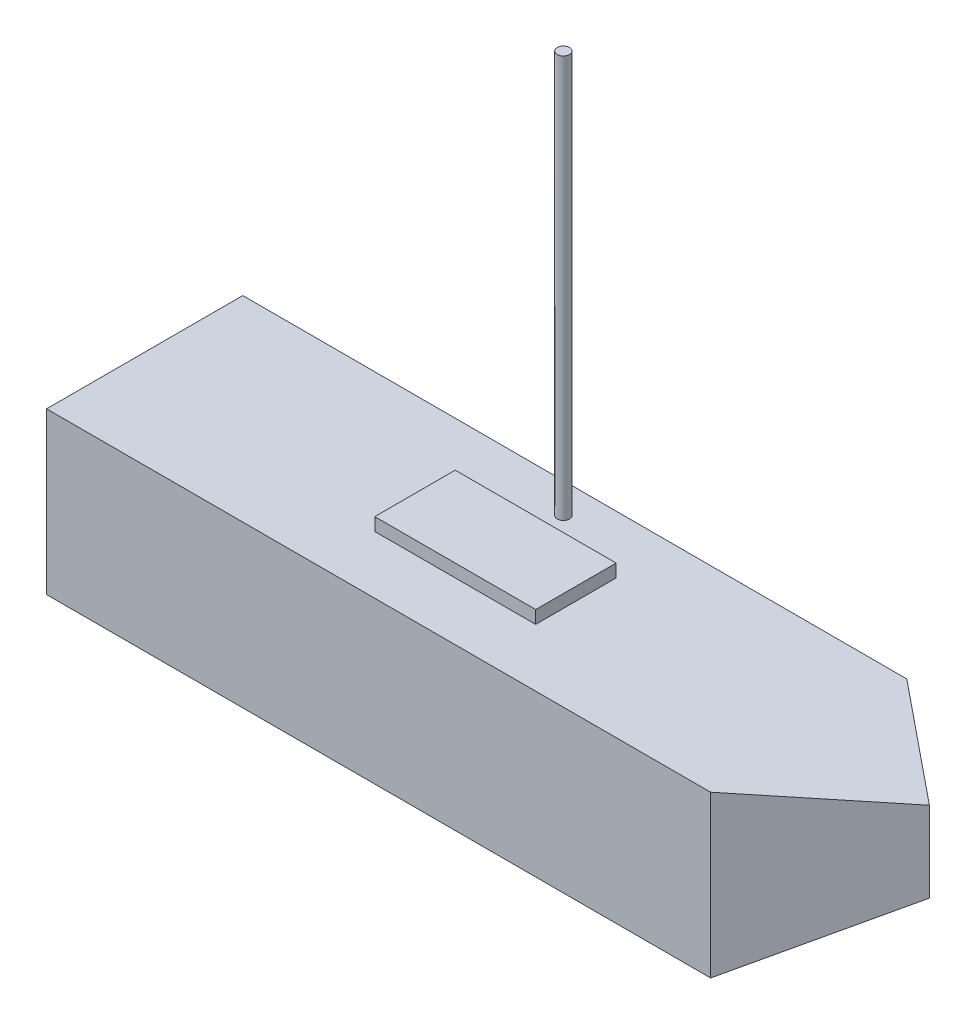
ISO-10303-21;
HEADER;
FILE_DESCRIPTION(('STEP AP214'),'2;1');
FILE_NAME('part.step','',(''),(''),'','','');
FILE_SCHEMA(('AUTOMOTIVE_DESIGN { 1 0 10303 214 1 1 1 1 }'));
ENDSEC;
DATA;
#1=APPLICATION_CONTEXT('core data for automotive mechanical design processes');
#2=APPLICATION_PROTOCOL_DEFINITION('international standard','automotive_design',2000,#1);
#3=PRODUCT_CONTEXT('',#1,'mechanical');
#4=PRODUCT('Part','Part','',(#3));
#5=PRODUCT_RELATED_PRODUCT_CATEGORY('part','',(#4));
#6=PRODUCT_DEFINITION_FORMATION('','',#4);
#7=PRODUCT_DEFINITION_CONTEXT('part definition',#1,'design');
#8=PRODUCT_DEFINITION('design','',#6,#7);
#9=PRODUCT_DEFINITION_SHAPE('','',#8);
#10=(LENGTH_UNIT() NAMED_UNIT(*) SI_UNIT(.MILLI.,.METRE.));
#11=(NAMED_UNIT(*) PLANE_ANGLE_UNIT() SI_UNIT($,.RADIAN.));
#12=(NAMED_UNIT(*) SI_UNIT($,.STERADIAN.) SOLID_ANGLE_UNIT());
#13=UNCERTAINTY_MEASURE_WITH_UNIT(LENGTH_MEASURE(1.E-05),#10,'distance_accuracy_value','');
#14=(GEOMETRIC_REPRESENTATION_CONTEXT(3) GLOBAL_UNCERTAINTY_ASSIGNED_CONTEXT((#13)) GLOBAL_UNIT_ASSIGNED_CONTEXT((#10,
#11,#12)) REPRESENTATION_CONTEXT('',''));
#15=CARTESIAN_POINT('',(0.,0.,0.));
#16=DIRECTION('',(0.,0.,1.));
#17=DIRECTION('',(1.,0.,0.));
#18=AXIS2_PLACEMENT_3D('',#15,#16,#17);
#19=CARTESIAN_POINT('',(0.,0.,0.));
#20=DIRECTION('',(0.,-1.,0.));
#21=DIRECTION('',(0.,0.,-1.));
#22=AXIS2_PLACEMENT_3D('',#19,#20,#21);
#23=PLANE('',#22);
#24=DIRECTION('',(0.,0.,1.));
#25=VECTOR('',#24,1.);
#26=CARTESIAN_POINT('',(906.7,0.,-298.65));
#27=LINE('',#26,#25);
#28=CARTESIAN_POINT('',(906.7,0.,-298.65));
#29=VERTEX_POINT('',#28);
#30=CARTESIAN_POINT('',(906.7,0.,-6.1500000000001));
#31=VERTEX_POINT('',#30);
#32=EDGE_CURVE('E219',#29,#31,#27,.T.);
#33=ORIENTED_EDGE('',*,*,#32,.F.);
#34=DIRECTION('',(1.,0.,0.));
#35=VECTOR('',#34,1.);
#36=CARTESIAN_POINT('',(906.7,0.,-298.65));
#37=LINE('',#36,#35);
#38=CARTESIAN_POINT('',(719.2,0.,-298.65));
#39=VERTEX_POINT('',#38);
#40=EDGE_CURVE('E230',#39,#29,#37,.T.);
#41=ORIENTED_EDGE('',*,*,#40,.F.);
#42=DIRECTION('',(0.,0.,1.));
#43=VECTOR('',#42,1.);
#44=CARTESIAN_POINT('',(719.2,0.,-298.65));
#45=LINE('',#44,#43);
#46=CARTESIAN_POINT('',(719.2,0.,-6.1500000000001));
#47=VERTEX_POINT('',#46);
#48=EDGE_CURVE('E218',#39,#47,#45,.T.);
#49=ORIENTED_EDGE('',*,*,#48,.T.);
#50=DIRECTION('',(1.,0.,0.));
#51=VECTOR('',#50,1.);
#52=CARTESIAN_POINT('',(906.7,0.,-6.1500000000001));
#53=LINE('',#52,#51);
#54=EDGE_CURVE('E234',#47,#31,#53,.T.);
#55=ORIENTED_EDGE('',*,*,#54,.T.);
#56=EDGE_LOOP('',(#33,#41,#49,#55));
#57=FACE_BOUND('',#56,.T.);
#58=DIRECTION('',(-1.,0.,0.));
#59=VECTOR('',#58,1.);
#60=CARTESIAN_POINT('',(0.,0.,-304.8));
#61=LINE('',#60,#59);
#62=CARTESIAN_POINT('',(1031.7,0.,-304.8));
#63=VERTEX_POINT('',#62);
#64=CARTESIAN_POINT('',(0.,0.,-304.8));
#65=VERTEX_POINT('',#64);
#66=EDGE_CURVE('E182',#63,#65,#61,.T.);
#67=ORIENTED_EDGE('',*,*,#66,.F.);
#68=DIRECTION('',(0.,0.,1.));
#69=VECTOR('',#68,1.);
#70=CARTESIAN_POINT('',(1031.7,0.,-152.4));
#71=LINE('',#70,#69);
#72=CARTESIAN_POINT('',(1031.7,0.,0.));
#73=VERTEX_POINT('',#72);
#74=EDGE_CURVE('E161',#63,#73,#71,.T.);
#75=ORIENTED_EDGE('',*,*,#74,.T.);
#76=DIRECTION('',(1.,0.,0.));
#77=VECTOR('',#76,1.);
#78=CARTESIAN_POINT('',(0.,0.,0.));
#79=LINE('',#78,#77);
#80=CARTESIAN_POINT('',(0.,0.,0.));
#81=VERTEX_POINT('',#80);
#82=EDGE_CURVE('E191',#81,#73,#79,.T.);
#83=ORIENTED_EDGE('',*,*,#82,.F.);
#84=DIRECTION('',(0.,0.,1.));
#85=VECTOR('',#84,1.);
#86=CARTESIAN_POINT('',(0.,0.,0.));
#87=LINE('',#86,#85);
#88=EDGE_CURVE('E189',#65,#81,#87,.T.);
#89=ORIENTED_EDGE('',*,*,#88,.F.);
#90=EDGE_LOOP('',(#67,#75,#83,#89));
#91=FACE_BOUND('',#90,.T.);
#92=ADVANCED_FACE('F74',(#57,#91),#23,.T.);
#93=CARTESIAN_POINT('',(1219.2,0.,-152.4));
#94=DIRECTION('',(-0.630732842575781,0.,0.776000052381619));
#95=DIRECTION('',(0.776000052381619,0.,0.630732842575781));
#96=AXIS2_PLACEMENT_3D('',#93,#94,#95);
#97=PLANE('',#96);
#98=DIRECTION('',(0.689231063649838,0.459487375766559,0.56020700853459));
#99=VECTOR('',#98,1.);
#100=CARTESIAN_POINT('',(1125.45,62.5,-228.6));
#101=LINE('',#100,#99);
#102=CARTESIAN_POINT('',(1219.2,125.,-152.4));
#103=VERTEX_POINT('',#102);
#104=EDGE_CURVE('E89',#63,#103,#101,.T.);
#105=ORIENTED_EDGE('',*,*,#104,.F.);
#106=DIRECTION('',(0.,1.,0.));
#107=VECTOR('',#106,1.);
#108=CARTESIAN_POINT('',(1031.7,0.,-304.8));
#109=LINE('',#108,#107);
#110=CARTESIAN_POINT('',(1031.7,250.,-304.8));
#111=VERTEX_POINT('',#110);
#112=EDGE_CURVE('E174',#63,#111,#109,.T.);
#113=ORIENTED_EDGE('',*,*,#112,.T.);
#114=DIRECTION('',(0.776000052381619,0.,0.630732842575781));
#115=VECTOR('',#114,1.);
#116=CARTESIAN_POINT('',(1219.2,250.,-152.4));
#117=LINE('',#116,#115);
#118=CARTESIAN_POINT('',(1219.2,250.,-152.4));
#119=VERTEX_POINT('',#118);
#120=EDGE_CURVE('E185',#111,#119,#117,.T.);
#121=ORIENTED_EDGE('',*,*,#120,.T.);
#122=DIRECTION('',(0.,1.,0.));
#123=VECTOR('',#122,1.);
#124=CARTESIAN_POINT('',(1219.2,0.,-152.4));
#125=LINE('',#124,#123);
#126=EDGE_CURVE('E176',#103,#119,#125,.T.);
#127=ORIENTED_EDGE('',*,*,#126,.F.);
#128=EDGE_LOOP('',(#105,#113,#121,#127));
#129=FACE_BOUND('',#128,.T.);
#130=ADVANCED_FACE('F172',(#129),#97,.F.);
#131=CARTESIAN_POINT('',(1219.2,0.,-152.4));
#132=DIRECTION('',(-0.63073284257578,0.,-0.77600005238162));
#133=DIRECTION('',(-0.77600005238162,0.,0.63073284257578));
#134=AXIS2_PLACEMENT_3D('',#131,#132,#133);
#135=PLANE('',#134);
#136=DIRECTION('',(0.689231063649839,0.459487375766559,-0.560207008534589));
#137=VECTOR('',#136,1.);
#138=CARTESIAN_POINT('',(1125.45,62.5,-76.2));
#139=LINE('',#138,#137);
#140=EDGE_CURVE('E163',#73,#103,#139,.T.);
#141=ORIENTED_EDGE('',*,*,#140,.T.);
#142=ORIENTED_EDGE('',*,*,#126,.T.);
#143=DIRECTION('',(-0.776000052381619,0.,0.63073284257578));
#144=VECTOR('',#143,1.);
#145=CARTESIAN_POINT('',(1219.2,250.,-152.4));
#146=LINE('',#145,#144);
#147=CARTESIAN_POINT('',(1031.7,250.,0.));
#148=VERTEX_POINT('',#147);
#149=EDGE_CURVE('E216',#119,#148,#146,.T.);
#150=ORIENTED_EDGE('',*,*,#149,.T.);
#151=DIRECTION('',(0.,1.,0.));
#152=VECTOR('',#151,1.);
#153=CARTESIAN_POINT('',(1031.7,0.,0.));
#154=LINE('',#153,#152);
#155=EDGE_CURVE('E214',#73,#148,#154,.T.);
#156=ORIENTED_EDGE('',*,*,#155,.F.);
#157=EDGE_LOOP('',(#141,#142,#150,#156));
#158=FACE_BOUND('',#157,.T.);
#159=ADVANCED_FACE('F277',(#158),#135,.F.);
#160=CARTESIAN_POINT('',(0.,250.,0.));
#161=DIRECTION('',(0.,-1.,0.));
#162=DIRECTION('',(0.,0.,-1.));
#163=AXIS2_PLACEMENT_3D('',#160,#161,#162);
#164=PLANE('',#163);
#165=CARTESIAN_POINT('',(545.,250.,-257.925));
#166=DIRECTION('',(0.,-1.,0.));
#167=DIRECTION('',(0.,0.,-1.));
#168=AXIS2_PLACEMENT_3D('',#165,#166,#167);
#169=CIRCLE('',#168,9.52500000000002);
#170=CARTESIAN_POINT('',(545.,250.,-267.45));
#171=VERTEX_POINT('',#170);
#172=EDGE_CURVE('E14',#171,#171,#169,.F.);
#173=ORIENTED_EDGE('',*,*,#172,.F.);
#174=EDGE_LOOP('',(#173));
#175=FACE_BOUND('',#174,.T.);
#176=DIRECTION('',(1.,0.,0.));
#177=VECTOR('',#176,1.);
#178=CARTESIAN_POINT('',(0.,250.,0.));
#179=LINE('',#178,#177);
#180=CARTESIAN_POINT('',(0.,250.,0.));
#181=VERTEX_POINT('',#180);
#182=EDGE_CURVE('E194',#181,#148,#179,.T.);
#183=ORIENTED_EDGE('',*,*,#182,.T.);
#184=ORIENTED_EDGE('',*,*,#149,.F.);
#185=ORIENTED_EDGE('',*,*,#120,.F.);
#186=DIRECTION('',(-1.,0.,0.));
#187=VECTOR('',#186,1.);
#188=CARTESIAN_POINT('',(0.,250.,-304.8));
#189=LINE('',#188,#187);
#190=CARTESIAN_POINT('',(0.,250.,-304.8));
#191=VERTEX_POINT('',#190);
#192=EDGE_CURVE('E184',#111,#191,#189,.T.);
#193=ORIENTED_EDGE('',*,*,#192,.T.);
#194=DIRECTION('',(0.,0.,1.));
#195=VECTOR('',#194,1.);
#196=CARTESIAN_POINT('',(0.,250.,0.));
#197=LINE('',#196,#195);
#198=EDGE_CURVE('E190',#191,#181,#197,.T.);
#199=ORIENTED_EDGE('',*,*,#198,.T.);
#200=EDGE_LOOP('',(#183,#184,#185,#193,#199));
#201=FACE_BOUND('',#200,.T.);
#202=DIRECTION('',(0.,0.,1.));
#203=VECTOR('',#202,1.);
#204=CARTESIAN_POINT('',(420.,250.,-89.9000000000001));
#205=LINE('',#204,#203);
#206=CARTESIAN_POINT('',(420.,250.,-214.9));
#207=VERTEX_POINT('',#206);
#208=CARTESIAN_POINT('',(420.,250.,-89.9000000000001));
#209=VERTEX_POINT('',#208);
#210=EDGE_CURVE('E264',#207,#209,#205,.T.);
#211=ORIENTED_EDGE('',*,*,#210,.F.);
#212=DIRECTION('',(-1.,0.,0.));
#213=VECTOR('',#212,1.);
#214=CARTESIAN_POINT('',(420.,250.,-214.9));
#215=LINE('',#214,#213);
#216=CARTESIAN_POINT('',(670.,250.,-214.9));
#217=VERTEX_POINT('',#216);
#218=EDGE_CURVE('E256',#217,#207,#215,.T.);
#219=ORIENTED_EDGE('',*,*,#218,.F.);
#220=DIRECTION('',(0.,0.,-1.));
#221=VECTOR('',#220,1.);
#222=CARTESIAN_POINT('',(670.,250.,-89.9000000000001));
#223=LINE('',#222,#221);
#224=CARTESIAN_POINT('',(670.,250.,-89.9000000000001));
#225=VERTEX_POINT('',#224);
#226=EDGE_CURVE('E260',#225,#217,#223,.T.);
#227=ORIENTED_EDGE('',*,*,#226,.F.);
#228=DIRECTION('',(1.,0.,0.));
#229=VECTOR('',#228,1.);
#230=CARTESIAN_POINT('',(420.,250.,-89.9000000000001));
#231=LINE('',#230,#229);
#232=EDGE_CURVE('E97',#209,#225,#231,.T.);
#233=ORIENTED_EDGE('',*,*,#232,.F.);
#234=EDGE_LOOP('',(#211,#219,#227,#233));
#235=FACE_BOUND('',#234,.T.);
#236=ADVANCED_FACE('F280',(#175,#201,#235),#164,.F.);
#237=CARTESIAN_POINT('',(0.,250.,0.));
#238=DIRECTION('',(1.,0.,0.));
#239=DIRECTION('',(0.,0.,-1.));
#240=AXIS2_PLACEMENT_3D('',#237,#238,#239);
#241=PLANE('',#240);
#242=ORIENTED_EDGE('',*,*,#88,.T.);
#243=DIRECTION('',(0.,-1.,0.));
#244=VECTOR('',#243,1.);
#245=CARTESIAN_POINT('',(0.,250.,0.));
#246=LINE('',#245,#244);
#247=EDGE_CURVE('E82',#181,#81,#246,.T.);
#248=ORIENTED_EDGE('',*,*,#247,.F.);
#249=ORIENTED_EDGE('',*,*,#198,.F.);
#250=DIRECTION('',(0.,-1.,0.));
#251=VECTOR('',#250,1.);
#252=CARTESIAN_POINT('',(0.,250.,-304.8));
#253=LINE('',#252,#251);
#254=EDGE_CURVE('E200',#191,#65,#253,.T.);
#255=ORIENTED_EDGE('',*,*,#254,.T.);
#256=EDGE_LOOP('',(#242,#248,#249,#255));
#257=FACE_BOUND('',#256,.T.);
#258=ADVANCED_FACE('F76',(#257),#241,.F.);
#259=CARTESIAN_POINT('',(0.,250.,0.));
#260=DIRECTION('',(0.,0.,-1.));
#261=DIRECTION('',(-1.,0.,0.));
#262=AXIS2_PLACEMENT_3D('',#259,#260,#261);
#263=PLANE('',#262);
#264=ORIENTED_EDGE('',*,*,#82,.T.);
#265=ORIENTED_EDGE('',*,*,#155,.T.);
#266=ORIENTED_EDGE('',*,*,#182,.F.);
#267=ORIENTED_EDGE('',*,*,#247,.T.);
#268=EDGE_LOOP('',(#264,#265,#266,#267));
#269=FACE_BOUND('',#268,.T.);
#270=ADVANCED_FACE('F204',(#269),#263,.F.);
#271=CARTESIAN_POINT('',(0.,250.,-304.8));
#272=DIRECTION('',(0.,0.,1.));
#273=DIRECTION('',(1.,0.,0.));
#274=AXIS2_PLACEMENT_3D('',#271,#272,#273);
#275=PLANE('',#274);
#276=ORIENTED_EDGE('',*,*,#192,.F.);
#277=ORIENTED_EDGE('',*,*,#112,.F.);
#278=ORIENTED_EDGE('',*,*,#66,.T.);
#279=ORIENTED_EDGE('',*,*,#254,.F.);
#280=EDGE_LOOP('',(#276,#277,#278,#279));
#281=FACE_BOUND('',#280,.T.);
#282=ADVANCED_FACE('F180',(#281),#275,.F.);
#283=CARTESIAN_POINT('',(719.2,0.,-298.65));
#284=DIRECTION('',(-0.315977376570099,0.9487667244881,0.));
#285=DIRECTION('',(-0.9487667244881,-0.315977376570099,0.));
#286=AXIS2_PLACEMENT_3D('',#283,#284,#285);
#287=PLANE('',#286);
#288=DIRECTION('',(-0.9487667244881,-0.315977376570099,0.));
#289=VECTOR('',#288,1.);
#290=CARTESIAN_POINT('',(719.2,0.,-6.1500000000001));
#291=LINE('',#290,#289);
#292=CARTESIAN_POINT('',(969.2,83.2600281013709,-6.1500000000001));
#293=VERTEX_POINT('',#292);
#294=EDGE_CURVE('E227',#293,#47,#291,.T.);
#295=ORIENTED_EDGE('',*,*,#294,.T.);
#296=ORIENTED_EDGE('',*,*,#48,.F.);
#297=DIRECTION('',(-0.9487667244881,-0.315977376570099,0.));
#298=VECTOR('',#297,1.);
#299=CARTESIAN_POINT('',(719.2,0.,-298.65));
#300=LINE('',#299,#298);
#301=CARTESIAN_POINT('',(969.2,83.2600281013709,-298.65));
#302=VERTEX_POINT('',#301);
#303=EDGE_CURVE('E223',#302,#39,#300,.T.);
#304=ORIENTED_EDGE('',*,*,#303,.F.);
#305=DIRECTION('',(0.,0.,1.));
#306=VECTOR('',#305,1.);
#307=CARTESIAN_POINT('',(969.2,83.2600281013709,-298.65));
#308=LINE('',#307,#306);
#309=EDGE_CURVE('E222',#302,#293,#308,.T.);
#310=ORIENTED_EDGE('',*,*,#309,.T.);
#311=EDGE_LOOP('',(#295,#296,#304,#310));
#312=FACE_BOUND('',#311,.T.);
#313=ADVANCED_FACE('F320',(#312),#287,.F.);
#314=CARTESIAN_POINT('',(969.2,83.2600281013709,-298.65));
#315=DIRECTION('',(0.799746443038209,-0.600337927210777,0.));
#316=DIRECTION('',(0.600337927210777,0.799746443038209,0.));
#317=AXIS2_PLACEMENT_3D('',#314,#315,#316);
#318=PLANE('',#317);
#319=DIRECTION('',(0.600337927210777,0.799746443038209,0.));
#320=VECTOR('',#319,1.);
#321=CARTESIAN_POINT('',(969.2,83.2600281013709,-6.1500000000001));
#322=LINE('',#321,#320);
#323=EDGE_CURVE('E231',#31,#293,#322,.T.);
#324=ORIENTED_EDGE('',*,*,#323,.T.);
#325=ORIENTED_EDGE('',*,*,#309,.F.);
#326=DIRECTION('',(0.600337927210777,0.799746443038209,0.));
#327=VECTOR('',#326,1.);
#328=CARTESIAN_POINT('',(969.2,83.2600281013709,-298.65));
#329=LINE('',#328,#327);
#330=EDGE_CURVE('E240',#29,#302,#329,.T.);
#331=ORIENTED_EDGE('',*,*,#330,.F.);
#332=ORIENTED_EDGE('',*,*,#32,.T.);
#333=EDGE_LOOP('',(#324,#325,#331,#332));
#334=FACE_BOUND('',#333,.T.);
#335=ADVANCED_FACE('F401',(#334),#318,.F.);
#336=CARTESIAN_POINT('',(0.,0.,-298.65));
#337=DIRECTION('',(0.,0.,1.));
#338=DIRECTION('',(1.,0.,0.));
#339=AXIS2_PLACEMENT_3D('',#336,#337,#338);
#340=PLANE('',#339);
#341=ORIENTED_EDGE('',*,*,#40,.T.);
#342=ORIENTED_EDGE('',*,*,#330,.T.);
#343=ORIENTED_EDGE('',*,*,#303,.T.);
#344=EDGE_LOOP('',(#341,#342,#343));
#345=FACE_BOUND('',#344,.T.);
#346=ADVANCED_FACE('F393',(#345),#340,.T.);
#347=CARTESIAN_POINT('',(0.,0.,-6.1500000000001));
#348=DIRECTION('',(0.,0.,1.));
#349=DIRECTION('',(1.,0.,0.));
#350=AXIS2_PLACEMENT_3D('',#347,#348,#349);
#351=PLANE('',#350);
#352=ORIENTED_EDGE('',*,*,#54,.F.);
#353=ORIENTED_EDGE('',*,*,#294,.F.);
#354=ORIENTED_EDGE('',*,*,#323,.F.);
#355=EDGE_LOOP('',(#352,#353,#354));
#356=FACE_BOUND('',#355,.T.);
#357=ADVANCED_FACE('F308',(#356),#351,.F.);
#358=CARTESIAN_POINT('',(420.,270.,-89.9000000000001));
#359=DIRECTION('',(1.,0.,0.));
#360=DIRECTION('',(0.,0.,-1.));
#361=AXIS2_PLACEMENT_3D('',#358,#359,#360);
#362=PLANE('',#361);
#363=ORIENTED_EDGE('',*,*,#210,.T.);
#364=DIRECTION('',(0.,-1.,0.));
#365=VECTOR('',#364,1.);
#366=CARTESIAN_POINT('',(420.,270.,-89.9000000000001));
#367=LINE('',#366,#365);
#368=CARTESIAN_POINT('',(420.,270.,-89.9000000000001));
#369=VERTEX_POINT('',#368);
#370=EDGE_CURVE('E237',#369,#209,#367,.T.);
#371=ORIENTED_EDGE('',*,*,#370,.F.);
#372=DIRECTION('',(0.,0.,1.));
#373=VECTOR('',#372,1.);
#374=CARTESIAN_POINT('',(420.,270.,-89.9000000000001));
#375=LINE('',#374,#373);
#376=CARTESIAN_POINT('',(420.,270.,-214.9));
#377=VERTEX_POINT('',#376);
#378=EDGE_CURVE('E259',#377,#369,#375,.T.);
#379=ORIENTED_EDGE('',*,*,#378,.F.);
#380=DIRECTION('',(0.,-1.,0.));
#381=VECTOR('',#380,1.);
#382=CARTESIAN_POINT('',(420.,270.,-214.9));
#383=LINE('',#382,#381);
#384=EDGE_CURVE('E252',#377,#207,#383,.T.);
#385=ORIENTED_EDGE('',*,*,#384,.T.);
#386=EDGE_LOOP('',(#363,#371,#379,#385));
#387=FACE_BOUND('',#386,.T.);
#388=ADVANCED_FACE('F292',(#387),#362,.F.);
#389=CARTESIAN_POINT('',(420.,270.,-89.9000000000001));
#390=DIRECTION('',(0.,0.,-1.));
#391=DIRECTION('',(-1.,0.,0.));
#392=AXIS2_PLACEMENT_3D('',#389,#390,#391);
#393=PLANE('',#392);
#394=ORIENTED_EDGE('',*,*,#232,.T.);
#395=DIRECTION('',(0.,-1.,0.));
#396=VECTOR('',#395,1.);
#397=CARTESIAN_POINT('',(670.,270.,-89.9000000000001));
#398=LINE('',#397,#396);
#399=CARTESIAN_POINT('',(670.,270.,-89.9000000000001));
#400=VERTEX_POINT('',#399);
#401=EDGE_CURVE('E246',#400,#225,#398,.T.);
#402=ORIENTED_EDGE('',*,*,#401,.F.);
#403=DIRECTION('',(1.,0.,0.));
#404=VECTOR('',#403,1.);
#405=CARTESIAN_POINT('',(420.,270.,-89.9000000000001));
#406=LINE('',#405,#404);
#407=EDGE_CURVE('E270',#369,#400,#406,.T.);
#408=ORIENTED_EDGE('',*,*,#407,.F.);
#409=ORIENTED_EDGE('',*,*,#370,.T.);
#410=EDGE_LOOP('',(#394,#402,#408,#409));
#411=FACE_BOUND('',#410,.T.);
#412=ADVANCED_FACE('F300',(#411),#393,.F.);
#413=CARTESIAN_POINT('',(670.,270.,-89.9000000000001));
#414=DIRECTION('',(-1.,0.,0.));
#415=DIRECTION('',(0.,0.,1.));
#416=AXIS2_PLACEMENT_3D('',#413,#414,#415);
#417=PLANE('',#416);
#418=ORIENTED_EDGE('',*,*,#226,.T.);
#419=DIRECTION('',(0.,-1.,0.));
#420=VECTOR('',#419,1.);
#421=CARTESIAN_POINT('',(670.,270.,-214.9));
#422=LINE('',#421,#420);
#423=CARTESIAN_POINT('',(670.,270.,-214.9));
#424=VERTEX_POINT('',#423);
#425=EDGE_CURVE('E249',#424,#217,#422,.T.);
#426=ORIENTED_EDGE('',*,*,#425,.F.);
#427=DIRECTION('',(0.,0.,-1.));
#428=VECTOR('',#427,1.);
#429=CARTESIAN_POINT('',(670.,270.,-89.9000000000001));
#430=LINE('',#429,#428);
#431=EDGE_CURVE('E268',#400,#424,#430,.T.);
#432=ORIENTED_EDGE('',*,*,#431,.F.);
#433=ORIENTED_EDGE('',*,*,#401,.T.);
#434=EDGE_LOOP('',(#418,#426,#432,#433));
#435=FACE_BOUND('',#434,.T.);
#436=ADVANCED_FACE('F298',(#435),#417,.F.);
#437=CARTESIAN_POINT('',(420.,270.,-214.9));
#438=DIRECTION('',(0.,0.,1.));
#439=DIRECTION('',(1.,0.,0.));
#440=AXIS2_PLACEMENT_3D('',#437,#438,#439);
#441=PLANE('',#440);
#442=ORIENTED_EDGE('',*,*,#218,.T.);
#443=ORIENTED_EDGE('',*,*,#384,.F.);
#444=DIRECTION('',(-1.,0.,0.));
#445=VECTOR('',#444,1.);
#446=CARTESIAN_POINT('',(420.,270.,-214.9));
#447=LINE('',#446,#445);
#448=EDGE_CURVE('E255',#424,#377,#447,.T.);
#449=ORIENTED_EDGE('',*,*,#448,.F.);
#450=ORIENTED_EDGE('',*,*,#425,.T.);
#451=EDGE_LOOP('',(#442,#443,#449,#450));
#452=FACE_BOUND('',#451,.T.);
#453=ADVANCED_FACE('F288',(#452),#441,.F.);
#454=CARTESIAN_POINT('',(0.,270.,0.));
#455=DIRECTION('',(0.,-1.,0.));
#456=DIRECTION('',(0.,0.,-1.));
#457=AXIS2_PLACEMENT_3D('',#454,#455,#456);
#458=PLANE('',#457);
#459=ORIENTED_EDGE('',*,*,#378,.T.);
#460=ORIENTED_EDGE('',*,*,#407,.T.);
#461=ORIENTED_EDGE('',*,*,#431,.T.);
#462=ORIENTED_EDGE('',*,*,#448,.T.);
#463=EDGE_LOOP('',(#459,#460,#461,#462));
#464=FACE_BOUND('',#463,.T.);
#465=ADVANCED_FACE('F294',(#464),#458,.F.);
#466=CARTESIAN_POINT('',(545.,875.,-257.925));
#467=DIRECTION('',(0.,-1.,0.));
#468=DIRECTION('',(0.,0.,-1.));
#469=AXIS2_PLACEMENT_3D('',#466,#467,#468);
#470=CYLINDRICAL_SURFACE('',#469,9.52500000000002);
#471=CARTESIAN_POINT('',(545.,875.,-257.925));
#472=DIRECTION('',(0.,1.,0.));
#473=DIRECTION('',(0.,0.,1.));
#474=AXIS2_PLACEMENT_3D('',#471,#472,#473);
#475=CIRCLE('',#474,9.52500000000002);
#476=CARTESIAN_POINT('',(545.,875.,-248.4));
#477=VERTEX_POINT('',#476);
#478=EDGE_CURVE('E167',#477,#477,#475,.T.);
#479=ORIENTED_EDGE('',*,*,#478,.F.);
#480=EDGE_LOOP('',(#479));
#481=FACE_BOUND('',#480,.T.);
#482=ORIENTED_EDGE('',*,*,#172,.T.);
#483=EDGE_LOOP('',(#482));
#484=FACE_BOUND('',#483,.T.);
#485=ADVANCED_FACE('F358',(#481,#484),#470,.T.);
#486=CARTESIAN_POINT('',(545.,875.,-257.925));
#487=DIRECTION('',(0.,1.,0.));
#488=DIRECTION('',(0.,0.,1.));
#489=AXIS2_PLACEMENT_3D('',#486,#487,#488);
#490=PLANE('',#489);
#491=ORIENTED_EDGE('',*,*,#478,.T.);
#492=EDGE_LOOP('',(#491));
#493=FACE_BOUND('',#492,.T.);
#494=ADVANCED_FACE('F352',(#493),#490,.T.);
#495=CARTESIAN_POINT('',(1031.7,0.,-304.8));
#496=DIRECTION('',(0.554700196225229,-0.832050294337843,0.));
#497=DIRECTION('',(0.689231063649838,0.459487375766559,0.56020700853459));
#498=AXIS2_PLACEMENT_3D('',#495,#496,#497);
#499=PLANE('',#498);
#500=ORIENTED_EDGE('',*,*,#104,.T.);
#501=ORIENTED_EDGE('',*,*,#140,.F.);
#502=ORIENTED_EDGE('',*,*,#74,.F.);
#503=EDGE_LOOP('',(#500,#501,#502));
#504=FACE_BOUND('',#503,.T.);
#505=ADVANCED_FACE('F162',(#504),#499,.T.);
#506=CLOSED_SHELL('',(#92,#130,#159,#236,#258,#270,#282,#313,#335,#346,#357,#388,#412,#436,#453,
#465,#485,#494,#505));
#507=MANIFOLD_SOLID_BREP('B2',#506);
#508=ADVANCED_BREP_SHAPE_REPRESENTATION('',(#18,#507),#14);
#509=SHAPE_DEFINITION_REPRESENTATION(#9,#508);
ENDSEC;
END-ISO-10303-21;
